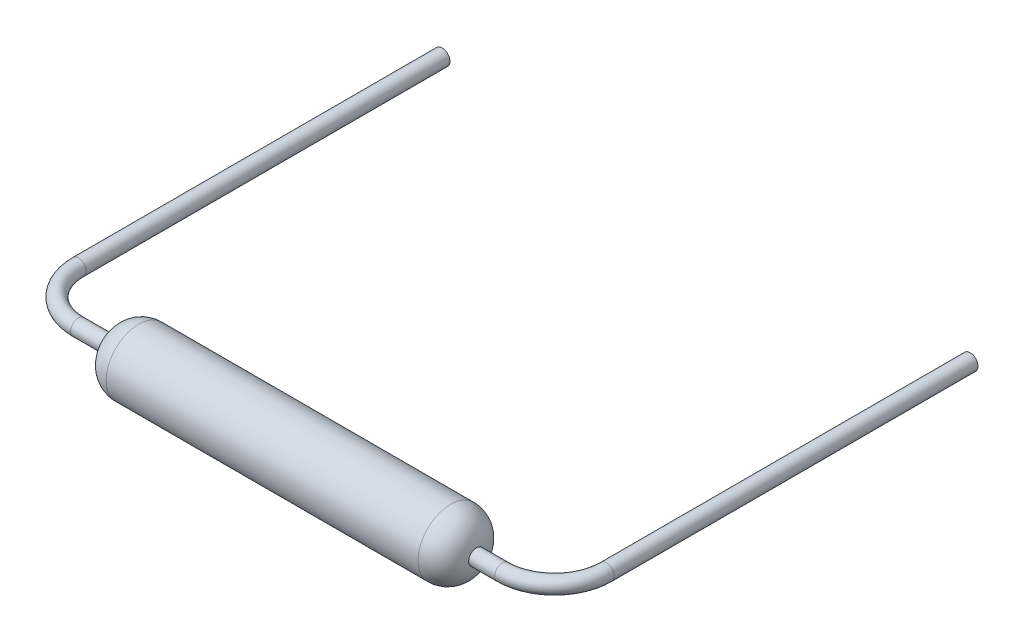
ISO-10303-21;
HEADER;
FILE_DESCRIPTION(('STEP AP214'),'2;1');
FILE_NAME('part.step','',(''),(''),'','','');
FILE_SCHEMA(('AUTOMOTIVE_DESIGN { 1 0 10303 214 1 1 1 1 }'));
ENDSEC;
DATA;
#1=APPLICATION_CONTEXT('core data for automotive mechanical design processes');
#2=APPLICATION_PROTOCOL_DEFINITION('international standard','automotive_design',2000,#1);
#3=PRODUCT_CONTEXT('',#1,'mechanical');
#4=PRODUCT('Part','Part','',(#3));
#5=PRODUCT_RELATED_PRODUCT_CATEGORY('part','',(#4));
#6=PRODUCT_DEFINITION_FORMATION('','',#4);
#7=PRODUCT_DEFINITION_CONTEXT('part definition',#1,'design');
#8=PRODUCT_DEFINITION('design','',#6,#7);
#9=PRODUCT_DEFINITION_SHAPE('','',#8);
#10=(LENGTH_UNIT() NAMED_UNIT(*) SI_UNIT(.MILLI.,.METRE.));
#11=(NAMED_UNIT(*) PLANE_ANGLE_UNIT() SI_UNIT($,.RADIAN.));
#12=(NAMED_UNIT(*) SI_UNIT($,.STERADIAN.) SOLID_ANGLE_UNIT());
#13=UNCERTAINTY_MEASURE_WITH_UNIT(LENGTH_MEASURE(1.E-05),#10,'distance_accuracy_value','');
#14=(GEOMETRIC_REPRESENTATION_CONTEXT(3) GLOBAL_UNCERTAINTY_ASSIGNED_CONTEXT((#13)) GLOBAL_UNIT_ASSIGNED_CONTEXT((#10,
#11,#12)) REPRESENTATION_CONTEXT('',''));
#15=CARTESIAN_POINT('',(0.,0.,0.));
#16=DIRECTION('',(0.,0.,1.));
#17=DIRECTION('',(1.,0.,0.));
#18=AXIS2_PLACEMENT_3D('',#15,#16,#17);
#19=CARTESIAN_POINT('',(2.,0.,16.));
#20=DIRECTION('',(1.,0.,0.));
#21=DIRECTION('',(0.,0.,-1.));
#22=AXIS2_PLACEMENT_3D('',#19,#20,#21);
#23=CYLINDRICAL_SURFACE('',#22,0.3);
#24=CARTESIAN_POINT('',(2.,0.,16.));
#25=DIRECTION('',(1.,0.,0.));
#26=DIRECTION('',(0.,0.,-1.));
#27=AXIS2_PLACEMENT_3D('',#24,#25,#26);
#28=CIRCLE('',#27,0.3);
#29=CARTESIAN_POINT('',(2.,0.,16.3));
#30=VERTEX_POINT('',#29);
#31=EDGE_CURVE('E56',#30,#30,#28,.T.);
#32=ORIENTED_EDGE('',*,*,#31,.T.);
#33=EDGE_LOOP('',(#32));
#34=FACE_BOUND('',#33,.T.);
#35=CARTESIAN_POINT('',(3.32,0.,16.));
#36=DIRECTION('',(1.,0.,0.));
#37=DIRECTION('',(0.,0.,-1.));
#38=AXIS2_PLACEMENT_3D('',#35,#36,#37);
#39=CIRCLE('',#38,0.3);
#40=CARTESIAN_POINT('',(3.32,0.,15.7));
#41=VERTEX_POINT('',#40);
#42=EDGE_CURVE('E51',#41,#41,#39,.T.);
#43=ORIENTED_EDGE('',*,*,#42,.F.);
#44=EDGE_LOOP('',(#43));
#45=FACE_BOUND('',#44,.T.);
#46=ADVANCED_FACE('F37',(#34,#45),#23,.T.);
#47=CARTESIAN_POINT('',(2.,0.,14.));
#48=DIRECTION('',(0.,1.,0.));
#49=DIRECTION('',(0.,0.,1.));
#50=AXIS2_PLACEMENT_3D('',#47,#48,#49);
#51=TOROIDAL_SURFACE('',#50,2.,0.3);
#52=CARTESIAN_POINT('',(0.,0.,14.));
#53=DIRECTION('',(0.,0.,1.));
#54=DIRECTION('',(1.,0.,0.));
#55=AXIS2_PLACEMENT_3D('',#52,#53,#54);
#56=CIRCLE('',#55,0.3);
#57=CARTESIAN_POINT('',(-0.299999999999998,0.,14.));
#58=VERTEX_POINT('',#57);
#59=EDGE_CURVE('E59',#58,#58,#56,.T.);
#60=CARTESIAN_POINT('',(2.,0.,14.));
#61=DIRECTION('',(0.,1.,0.));
#62=DIRECTION('',(0.,0.,1.));
#63=AXIS2_PLACEMENT_3D('',#60,#61,#62);
#64=CIRCLE('',#63,2.3);
#65=EDGE_CURVE('',#58,#30,#64,.T.);
#66=ORIENTED_EDGE('',*,*,#59,.T.);
#67=ORIENTED_EDGE('',*,*,#31,.F.);
#68=ORIENTED_EDGE('',*,*,#65,.T.);
#69=ORIENTED_EDGE('',*,*,#65,.F.);
#70=EDGE_LOOP('',(#66,#68,#67,#69));
#71=FACE_BOUND('',#70,.T.);
#72=ADVANCED_FACE('F100',(#71),#51,.T.);
#73=CARTESIAN_POINT('',(0.,0.,14.));
#74=DIRECTION('',(0.,0.,-1.));
#75=DIRECTION('',(-1.,0.,0.));
#76=AXIS2_PLACEMENT_3D('',#73,#74,#75);
#77=CYLINDRICAL_SURFACE('',#76,0.3);
#78=ORIENTED_EDGE('',*,*,#59,.F.);
#79=EDGE_LOOP('',(#78));
#80=FACE_BOUND('',#79,.T.);
#81=CARTESIAN_POINT('',(0.,0.,0.));
#82=DIRECTION('',(0.,0.,1.));
#83=DIRECTION('',(1.,0.,0.));
#84=AXIS2_PLACEMENT_3D('',#81,#82,#83);
#85=CIRCLE('',#84,0.3);
#86=CARTESIAN_POINT('',(0.3,0.,0.));
#87=VERTEX_POINT('',#86);
#88=EDGE_CURVE('E62',#87,#87,#85,.T.);
#89=ORIENTED_EDGE('',*,*,#88,.T.);
#90=EDGE_LOOP('',(#89));
#91=FACE_BOUND('',#90,.T.);
#92=ADVANCED_FACE('F105',(#80,#91),#77,.T.);
#93=CARTESIAN_POINT('',(0.,0.,0.));
#94=DIRECTION('',(0.,0.,1.));
#95=DIRECTION('',(1.,0.,0.));
#96=AXIS2_PLACEMENT_3D('',#93,#94,#95);
#97=PLANE('',#96);
#98=ORIENTED_EDGE('',*,*,#88,.F.);
#99=EDGE_LOOP('',(#98));
#100=FACE_BOUND('',#99,.T.);
#101=ADVANCED_FACE('F115',(#100),#97,.F.);
#102=CARTESIAN_POINT('',(17.32,0.,16.));
#103=DIRECTION('',(-1.,0.,0.));
#104=DIRECTION('',(0.,0.,1.));
#105=AXIS2_PLACEMENT_3D('',#102,#103,#104);
#106=CYLINDRICAL_SURFACE('',#105,1.25);
#107=CARTESIAN_POINT('',(16.3212507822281,0.,16.));
#108=DIRECTION('',(1.,0.,0.));
#109=DIRECTION('',(0.,0.,-1.));
#110=AXIS2_PLACEMENT_3D('',#107,#108,#109);
#111=CIRCLE('',#110,1.25);
#112=CARTESIAN_POINT('',(16.3212507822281,0.,14.75));
#113=VERTEX_POINT('',#112);
#114=EDGE_CURVE('E10',#113,#113,#111,.F.);
#115=ORIENTED_EDGE('',*,*,#114,.T.);
#116=EDGE_LOOP('',(#115));
#117=FACE_BOUND('',#116,.T.);
#118=CARTESIAN_POINT('',(4.31874921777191,0.,16.));
#119=DIRECTION('',(-1.,0.,0.));
#120=DIRECTION('',(0.,0.,1.));
#121=AXIS2_PLACEMENT_3D('',#118,#119,#120);
#122=CIRCLE('',#121,1.25);
#123=CARTESIAN_POINT('',(4.31874921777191,0.,17.25));
#124=VERTEX_POINT('',#123);
#125=EDGE_CURVE('E43',#124,#124,#122,.F.);
#126=ORIENTED_EDGE('',*,*,#125,.T.);
#127=EDGE_LOOP('',(#126));
#128=FACE_BOUND('',#127,.T.);
#129=ADVANCED_FACE('F121',(#117,#128),#106,.T.);
#130=CARTESIAN_POINT('',(20.32,0.,14.));
#131=DIRECTION('',(0.,0.,-1.));
#132=DIRECTION('',(-1.,0.,0.));
#133=AXIS2_PLACEMENT_3D('',#130,#131,#132);
#134=CYLINDRICAL_SURFACE('',#133,0.3);
#135=CARTESIAN_POINT('',(20.32,0.,14.));
#136=DIRECTION('',(0.,0.,-1.));
#137=DIRECTION('',(-1.,0.,0.));
#138=AXIS2_PLACEMENT_3D('',#135,#136,#137);
#139=CIRCLE('',#138,0.3);
#140=CARTESIAN_POINT('',(20.62,0.,14.));
#141=VERTEX_POINT('',#140);
#142=EDGE_CURVE('E68',#141,#141,#139,.T.);
#143=ORIENTED_EDGE('',*,*,#142,.T.);
#144=EDGE_LOOP('',(#143));
#145=FACE_BOUND('',#144,.T.);
#146=CARTESIAN_POINT('',(20.32,0.,0.));
#147=DIRECTION('',(0.,0.,-1.));
#148=DIRECTION('',(-1.,0.,0.));
#149=AXIS2_PLACEMENT_3D('',#146,#147,#148);
#150=CIRCLE('',#149,0.3);
#151=CARTESIAN_POINT('',(20.02,0.,0.));
#152=VERTEX_POINT('',#151);
#153=EDGE_CURVE('E65',#152,#152,#150,.T.);
#154=ORIENTED_EDGE('',*,*,#153,.F.);
#155=EDGE_LOOP('',(#154));
#156=FACE_BOUND('',#155,.T.);
#157=ADVANCED_FACE('F124',(#145,#156),#134,.T.);
#158=CARTESIAN_POINT('',(18.32,0.,14.));
#159=DIRECTION('',(0.,1.,0.));
#160=DIRECTION('',(0.,0.,1.));
#161=AXIS2_PLACEMENT_3D('',#158,#159,#160);
#162=TOROIDAL_SURFACE('',#161,2.,0.3);
#163=CARTESIAN_POINT('',(18.32,0.,16.));
#164=DIRECTION('',(1.,0.,0.));
#165=DIRECTION('',(0.,0.,-1.));
#166=AXIS2_PLACEMENT_3D('',#163,#164,#165);
#167=CIRCLE('',#166,0.3);
#168=CARTESIAN_POINT('',(18.32,0.,16.3));
#169=VERTEX_POINT('',#168);
#170=EDGE_CURVE('E71',#169,#169,#167,.T.);
#171=CARTESIAN_POINT('',(18.32,0.,14.));
#172=DIRECTION('',(0.,1.,0.));
#173=DIRECTION('',(0.,0.,1.));
#174=AXIS2_PLACEMENT_3D('',#171,#172,#173);
#175=CIRCLE('',#174,2.3);
#176=EDGE_CURVE('',#169,#141,#175,.T.);
#177=ORIENTED_EDGE('',*,*,#170,.T.);
#178=ORIENTED_EDGE('',*,*,#142,.F.);
#179=ORIENTED_EDGE('',*,*,#176,.T.);
#180=ORIENTED_EDGE('',*,*,#176,.F.);
#181=EDGE_LOOP('',(#177,#179,#178,#180));
#182=FACE_BOUND('',#181,.T.);
#183=ADVANCED_FACE('F75',(#182),#162,.T.);
#184=CARTESIAN_POINT('',(18.32,0.,16.));
#185=DIRECTION('',(-1.,0.,0.));
#186=DIRECTION('',(0.,0.,1.));
#187=AXIS2_PLACEMENT_3D('',#184,#185,#186);
#188=CYLINDRICAL_SURFACE('',#187,0.3);
#189=ORIENTED_EDGE('',*,*,#170,.F.);
#190=EDGE_LOOP('',(#189));
#191=FACE_BOUND('',#190,.T.);
#192=CARTESIAN_POINT('',(17.32,0.,16.));
#193=DIRECTION('',(1.,0.,0.));
#194=DIRECTION('',(0.,0.,-1.));
#195=AXIS2_PLACEMENT_3D('',#192,#193,#194);
#196=CIRCLE('',#195,0.3);
#197=CARTESIAN_POINT('',(17.32,0.,15.7));
#198=VERTEX_POINT('',#197);
#199=EDGE_CURVE('E47',#198,#198,#196,.T.);
#200=ORIENTED_EDGE('',*,*,#199,.T.);
#201=EDGE_LOOP('',(#200));
#202=FACE_BOUND('',#201,.T.);
#203=ADVANCED_FACE('F78',(#191,#202),#188,.T.);
#204=CARTESIAN_POINT('',(20.32,0.,0.));
#205=DIRECTION('',(0.,0.,-1.));
#206=DIRECTION('',(-1.,0.,0.));
#207=AXIS2_PLACEMENT_3D('',#204,#205,#206);
#208=PLANE('',#207);
#209=ORIENTED_EDGE('',*,*,#153,.T.);
#210=EDGE_LOOP('',(#209));
#211=FACE_BOUND('',#210,.T.);
#212=ADVANCED_FACE('F81',(#211),#208,.T.);
#213=CARTESIAN_POINT('',(16.3212507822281,0.,16.));
#214=DIRECTION('',(1.,0.,0.));
#215=DIRECTION('',(0.,0.,-1.));
#216=AXIS2_PLACEMENT_3D('',#213,#214,#215);
#217=DEGENERATE_TOROIDAL_SURFACE('',#216,0.249999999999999,1.,.T.);
#218=ORIENTED_EDGE('',*,*,#114,.F.);
#219=EDGE_LOOP('',(#218));
#220=FACE_BOUND('',#219,.T.);
#221=ORIENTED_EDGE('',*,*,#199,.F.);
#222=EDGE_LOOP('',(#221));
#223=FACE_BOUND('',#222,.T.);
#224=ADVANCED_FACE('F85',(#220,#223),#217,.T.);
#225=CARTESIAN_POINT('',(4.31874921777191,0.,16.));
#226=DIRECTION('',(-1.,0.,0.));
#227=DIRECTION('',(0.,0.,1.));
#228=AXIS2_PLACEMENT_3D('',#225,#226,#227);
#229=DEGENERATE_TOROIDAL_SURFACE('',#228,0.249999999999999,1.,.T.);
#230=ORIENTED_EDGE('',*,*,#42,.T.);
#231=EDGE_LOOP('',(#230));
#232=FACE_BOUND('',#231,.T.);
#233=ORIENTED_EDGE('',*,*,#125,.F.);
#234=EDGE_LOOP('',(#233));
#235=FACE_BOUND('',#234,.T.);
#236=ADVANCED_FACE('F87',(#232,#235),#229,.T.);
#237=CLOSED_SHELL('',(#46,#72,#92,#101,#129,#157,#183,#203,#212,#224,#236));
#238=MANIFOLD_SOLID_BREP('B2',#237);
#239=ADVANCED_BREP_SHAPE_REPRESENTATION('',(#18,#238),#14);
#240=SHAPE_DEFINITION_REPRESENTATION(#9,#239);
ENDSEC;
END-ISO-10303-21;
